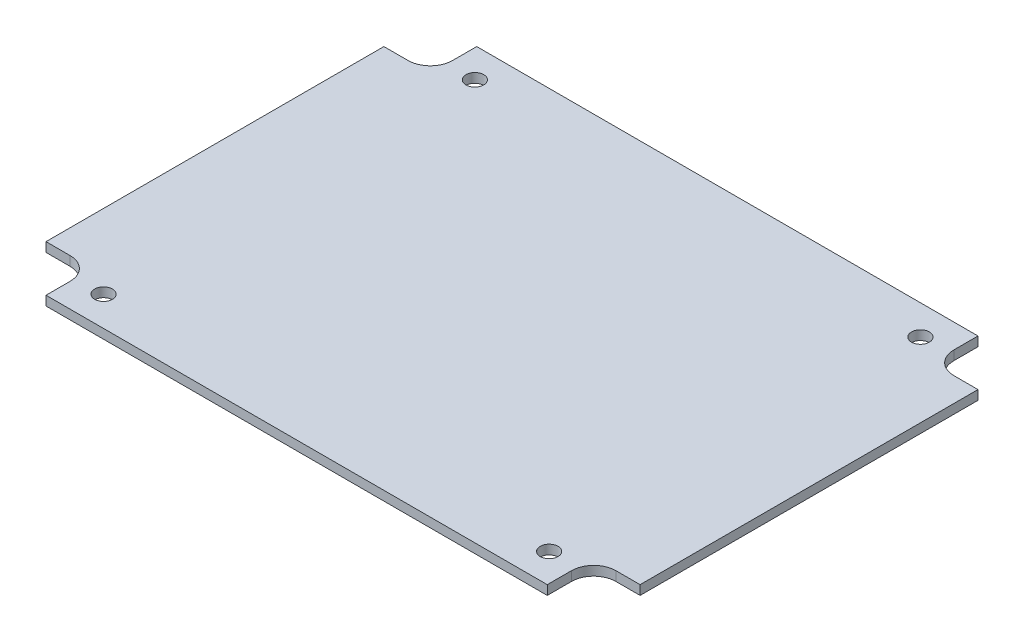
from build123d import *

# Parameters (mm, degrees)
SKETCH1_W          = 101.6
SKETCH1_H          = 73.66
EXTRUDE1_DEPTH     = 1.6002
CUT_EXTRUDE1_DEPTH = 126.502654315
SKETCH3_R          = 1.524
CUT_EXTRUDE2_DEPTH = 126.502654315


with BuildPart() as part:
    # Sketch1 → Extrude1 (new body)
    with BuildSketch(Plane(origin=(0, 0, 0), x_dir=(1, 0, 0), z_dir=(0, 1, 0))):
        with Locations((50.8, 36.83)):
            Rectangle(SKETCH1_W, SKETCH1_H)
    extrude(amount=EXTRUDE1_DEPTH)

    # Sketch2 → Cut-Extrude1 (cut, through all)
    with BuildSketch(Plane(origin=(0, 1.6002, 0), x_dir=(-1, 0, 0), z_dir=(0, 1, 0))):
        with BuildLine():
            Line((-93.6625, -73.66), (-93.6625, -69.5325))
            ThreePointArc((-93.6625, -69.5325), (-94.778423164, -66.838423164), (-97.4725, -65.7225))
            Line((-97.4725, -65.7225), (-101.6, -65.7225))
            Line((-101.6, -65.7225), (-101.6, -73.66))
            Line((-101.6, -73.66), (-93.6625, -73.66))
        make_face()
        with BuildLine():
            Line((-101.6, 0), (-93.6625, 0))
            Line((-93.6625, 0), (-93.6625, -4.1275))
            ThreePointArc((-93.6625, -4.1275), (-94.778423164, -6.821576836), (-97.4725, -7.9375))
            Line((-97.4725, -7.9375), (-101.6, -7.9375))
            Line((-101.6, -7.9375), (-101.6, 0))
        make_face()
        with BuildLine():
            Line((0, -73.66), (-7.9375, -73.66))
            Line((-7.9375, -73.66), (-7.9375, -69.5325))
            ThreePointArc((-7.9375, -69.5325), (-6.821576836, -66.838423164), (-4.1275, -65.7225))
            Line((-4.1275, -65.7225), (0, -65.7225))
            Line((0, -65.7225), (0, -73.66))
        make_face()
        with BuildLine():
            Line((-7.9375, 0), (-7.9375, -4.1275))
            ThreePointArc((-7.9375, -4.1275), (-6.821576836, -6.821576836), (-4.1275, -7.9375))
            Line((-4.1275, -7.9375), (0, -7.9375))
            Line((0, -7.9375), (0, 0))
            Line((0, 0), (-7.9375, 0))
        make_face()
    extrude(amount=-CUT_EXTRUDE1_DEPTH, mode=Mode.SUBTRACT)

    # Sketch3 → Cut-Extrude2 (cut, through all)
    with BuildSketch(Plane(origin=(0, 1.6002, 0), x_dir=(-1, 0, 0), z_dir=(0, 1, 0))):
        with Locations(Location((-88.9, -5.08, 0), (0, 0, 90))):
            Circle(SKETCH3_R)
        with Locations(Location((-88.9, -68.58, 0), (0, 0, 270))):
            Circle(SKETCH3_R)
        with Locations(Location((-12.7, -68.58, 0), (0, 0, 90))):
            Circle(SKETCH3_R)
        with Locations(Location((-12.7, -5.08, 0), (0, 0, 270))):
            Circle(SKETCH3_R)
    extrude(amount=-CUT_EXTRUDE2_DEPTH, mode=Mode.SUBTRACT)


solid = part.part
